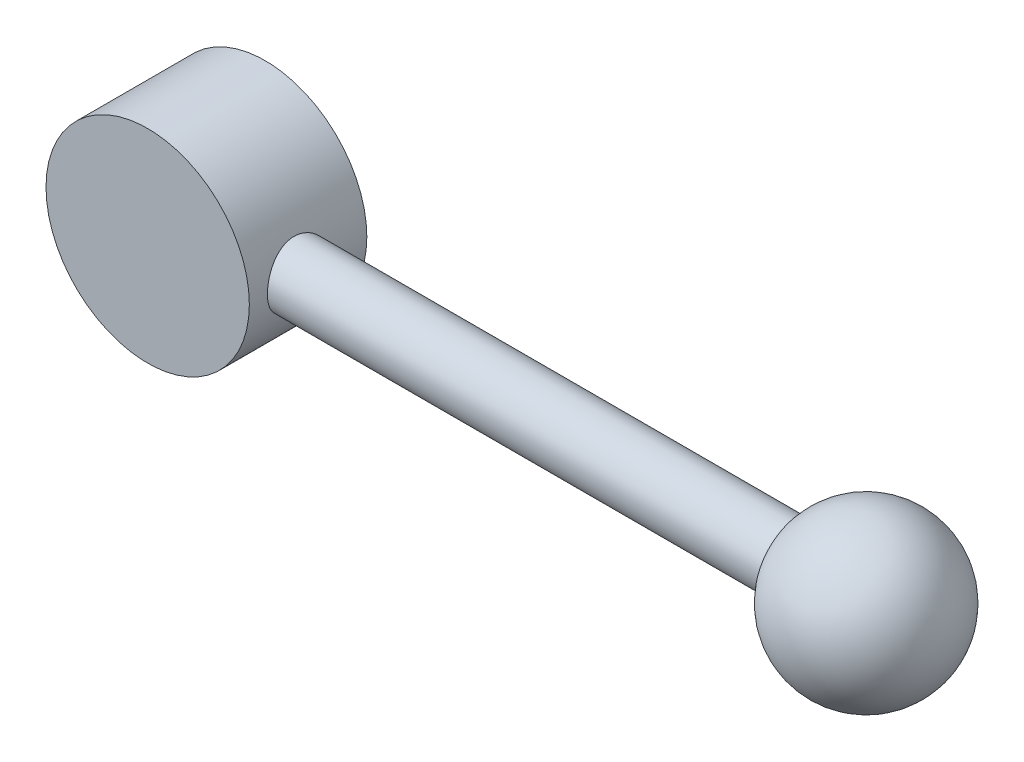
ISO-10303-21;
HEADER;
FILE_DESCRIPTION(('STEP AP214'),'2;1');
FILE_NAME('part.step','',(''),(''),'','','');
FILE_SCHEMA(('AUTOMOTIVE_DESIGN { 1 0 10303 214 1 1 1 1 }'));
ENDSEC;
DATA;
#1=APPLICATION_CONTEXT('core data for automotive mechanical design processes');
#2=APPLICATION_PROTOCOL_DEFINITION('international standard','automotive_design',2000,#1);
#3=PRODUCT_CONTEXT('',#1,'mechanical');
#4=PRODUCT('Part','Part','',(#3));
#5=PRODUCT_RELATED_PRODUCT_CATEGORY('part','',(#4));
#6=PRODUCT_DEFINITION_FORMATION('','',#4);
#7=PRODUCT_DEFINITION_CONTEXT('part definition',#1,'design');
#8=PRODUCT_DEFINITION('design','',#6,#7);
#9=PRODUCT_DEFINITION_SHAPE('','',#8);
#10=(LENGTH_UNIT() NAMED_UNIT(*) SI_UNIT(.MILLI.,.METRE.));
#11=(NAMED_UNIT(*) PLANE_ANGLE_UNIT() SI_UNIT($,.RADIAN.));
#12=(NAMED_UNIT(*) SI_UNIT($,.STERADIAN.) SOLID_ANGLE_UNIT());
#13=UNCERTAINTY_MEASURE_WITH_UNIT(LENGTH_MEASURE(1.E-05),#10,'distance_accuracy_value','');
#14=(GEOMETRIC_REPRESENTATION_CONTEXT(3) GLOBAL_UNCERTAINTY_ASSIGNED_CONTEXT((#13)) GLOBAL_UNIT_ASSIGNED_CONTEXT((#10,
#11,#12)) REPRESENTATION_CONTEXT('',''));
#15=CARTESIAN_POINT('',(0.,0.,0.));
#16=DIRECTION('',(0.,0.,1.));
#17=DIRECTION('',(1.,0.,0.));
#18=AXIS2_PLACEMENT_3D('',#15,#16,#17);
#19=CARTESIAN_POINT('',(0.,0.,0.));
#20=DIRECTION('',(0.,0.,1.));
#21=DIRECTION('',(1.,0.,0.));
#22=AXIS2_PLACEMENT_3D('',#19,#20,#21);
#23=PLANE('',#22);
#24=CARTESIAN_POINT('',(0.,0.,0.));
#25=DIRECTION('',(0.,0.,1.));
#26=DIRECTION('',(1.,0.,0.));
#27=AXIS2_PLACEMENT_3D('',#24,#25,#26);
#28=CIRCLE('',#27,11.5);
#29=CARTESIAN_POINT('',(11.5,0.,0.));
#30=VERTEX_POINT('',#29);
#31=EDGE_CURVE('E8',#30,#30,#28,.T.);
#32=ORIENTED_EDGE('',*,*,#31,.F.);
#33=EDGE_LOOP('',(#32));
#34=FACE_BOUND('',#33,.T.);
#35=CARTESIAN_POINT('',(0.,0.,0.));
#36=DIRECTION('',(0.,0.,-1.));
#37=DIRECTION('',(-1.,0.,0.));
#38=AXIS2_PLACEMENT_3D('',#35,#36,#37);
#39=CIRCLE('',#38,8.);
#40=CARTESIAN_POINT('',(-8.,0.,0.));
#41=VERTEX_POINT('',#40);
#42=EDGE_CURVE('E40',#41,#41,#39,.T.);
#43=ORIENTED_EDGE('',*,*,#42,.F.);
#44=EDGE_LOOP('',(#43));
#45=FACE_BOUND('',#44,.T.);
#46=ADVANCED_FACE('F12',(#34,#45),#23,.F.);
#47=CARTESIAN_POINT('',(0.,0.,40.));
#48=DIRECTION('',(0.,0.,1.));
#49=DIRECTION('',(1.,0.,0.));
#50=AXIS2_PLACEMENT_3D('',#47,#48,#49);
#51=CYLINDRICAL_SURFACE('',#50,11.5);
#52=CARTESIAN_POINT('',(0.,0.,2.));
#53=DIRECTION('',(0.,0.,1.));
#54=DIRECTION('',(1.,0.,0.));
#55=AXIS2_PLACEMENT_3D('',#52,#53,#54);
#56=CIRCLE('',#55,11.5);
#57=CARTESIAN_POINT('',(11.5,0.,2.));
#58=VERTEX_POINT('',#57);
#59=EDGE_CURVE('E34',#58,#58,#56,.T.);
#60=ORIENTED_EDGE('',*,*,#59,.F.);
#61=EDGE_LOOP('',(#60));
#62=FACE_BOUND('',#61,.T.);
#63=ORIENTED_EDGE('',*,*,#31,.T.);
#64=EDGE_LOOP('',(#63));
#65=FACE_BOUND('',#64,.T.);
#66=ADVANCED_FACE('F14',(#62,#65),#51,.T.);
#67=CARTESIAN_POINT('',(22.5,0.,28.));
#68=DIRECTION('',(0.,0.,-1.));
#69=DIRECTION('',(-1.,0.,0.));
#70=AXIS2_PLACEMENT_3D('',#67,#68,#69);
#71=PLANE('',#70);
#72=CARTESIAN_POINT('',(0.,0.,28.));
#73=DIRECTION('',(0.,0.,1.));
#74=DIRECTION('',(1.,0.,0.));
#75=AXIS2_PLACEMENT_3D('',#72,#73,#74);
#76=CIRCLE('',#75,22.5);
#77=CARTESIAN_POINT('',(22.5,0.,28.));
#78=VERTEX_POINT('',#77);
#79=EDGE_CURVE('E25',#78,#78,#76,.T.);
#80=ORIENTED_EDGE('',*,*,#79,.T.);
#81=EDGE_LOOP('',(#80));
#82=FACE_BOUND('',#81,.T.);
#83=ADVANCED_FACE('F70',(#82),#71,.F.);
#84=CARTESIAN_POINT('',(0.,0.,40.));
#85=DIRECTION('',(0.,0.,1.));
#86=DIRECTION('',(1.,0.,0.));
#87=AXIS2_PLACEMENT_3D('',#84,#85,#86);
#88=CYLINDRICAL_SURFACE('',#87,22.5);
#89=CARTESIAN_POINT('',(22.5,0.,10.));
#90=CARTESIAN_POINT('',(22.4999998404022,-0.191677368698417,10.0000002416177));
#91=CARTESIAN_POINT('',(22.4975448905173,-0.383358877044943,10.0078793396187));
#92=CARTESIAN_POINT('',(22.4877923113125,-0.765308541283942,10.0393229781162));
#93=CARTESIAN_POINT('',(22.4804945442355,-0.955576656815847,10.0628879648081));
#94=CARTESIAN_POINT('',(22.4612564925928,-1.33331254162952,10.1254869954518));
#95=CARTESIAN_POINT('',(22.4493161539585,-1.52078027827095,10.1645212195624));
#96=CARTESIAN_POINT('',(22.4211118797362,-1.89165112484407,10.2577281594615));
#97=CARTESIAN_POINT('',(22.4048463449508,-2.07505270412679,10.3119064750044));
#98=CARTESIAN_POINT('',(22.3684646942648,-2.43611329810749,10.4348153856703));
#99=CARTESIAN_POINT('',(22.3483561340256,-2.61378279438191,10.503517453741));
#100=CARTESIAN_POINT('',(22.3047888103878,-2.96265393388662,10.6550124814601));
#101=CARTESIAN_POINT('',(22.281328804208,-3.13385314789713,10.7378106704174));
#102=CARTESIAN_POINT('',(22.2316747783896,-3.46860942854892,10.9168465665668));
#103=CARTESIAN_POINT('',(22.2054814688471,-3.63216846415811,11.0130807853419));
#104=CARTESIAN_POINT('',(22.1510251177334,-3.95072830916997,11.2183306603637));
#105=CARTESIAN_POINT('',(22.1227612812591,-4.10572579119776,11.327351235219));
#106=CARTESIAN_POINT('',(22.0343532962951,-4.56462383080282,11.6788046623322));
#107=CARTESIAN_POINT('',(21.9719820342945,-4.85343322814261,11.9408249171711));
#108=CARTESIAN_POINT('',(21.8481078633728,-5.38374028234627,12.5092913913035));
#109=CARTESIAN_POINT('',(21.7866051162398,-5.62522922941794,12.8157457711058));
#110=CARTESIAN_POINT('',(21.6993823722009,-5.94977072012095,13.3067462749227));
#111=CARTESIAN_POINT('',(21.670827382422,-6.05269326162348,13.4779461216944));
#112=CARTESIAN_POINT('',(21.6165738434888,-6.24368405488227,13.8288405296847));
#113=CARTESIAN_POINT('',(21.5908741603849,-6.33175821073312,14.0085316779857));
#114=CARTESIAN_POINT('',(21.5431267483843,-6.49235835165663,14.3752387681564));
#115=CARTESIAN_POINT('',(21.5210797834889,-6.56488108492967,14.5622562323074));
#116=CARTESIAN_POINT('',(21.4813641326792,-6.69369414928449,14.9421700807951));
#117=CARTESIAN_POINT('',(21.4636935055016,-6.74999167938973,15.1350638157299));
#118=CARTESIAN_POINT('',(21.4337574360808,-6.84444485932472,15.5195916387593));
#119=CARTESIAN_POINT('',(21.4213480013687,-6.88308642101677,15.7110952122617));
#120=CARTESIAN_POINT('',(21.4016029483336,-6.94423696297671,16.0968445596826));
#121=CARTESIAN_POINT('',(21.3942652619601,-6.96675251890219,16.2910891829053));
#122=CARTESIAN_POINT('',(21.3848978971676,-6.99545358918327,16.6809027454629));
#123=CARTESIAN_POINT('',(21.382868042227,-7.00163964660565,16.8764716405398));
#124=CARTESIAN_POINT('',(21.3841835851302,-6.99762087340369,17.2674203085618));
#125=CARTESIAN_POINT('',(21.387528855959,-6.98741643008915,17.4628000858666));
#126=CARTESIAN_POINT('',(21.3992467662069,-6.95144410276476,17.8441910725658));
#127=CARTESIAN_POINT('',(21.4074162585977,-6.92630487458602,18.0302682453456));
#128=CARTESIAN_POINT('',(21.4283669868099,-6.86121389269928,18.3996136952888));
#129=CARTESIAN_POINT('',(21.4411497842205,-6.82125712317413,18.5828809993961));
#130=CARTESIAN_POINT('',(21.4709424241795,-6.7268919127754,18.9452428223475));
#131=CARTESIAN_POINT('',(21.4879510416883,-6.67248765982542,19.1243385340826));
#132=CARTESIAN_POINT('',(21.5257120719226,-6.54964475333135,19.4773149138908));
#133=CARTESIAN_POINT('',(21.5464659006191,-6.48120079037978,19.6511935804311));
#134=CARTESIAN_POINT('',(21.5914465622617,-6.32975192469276,19.9949996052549));
#135=CARTESIAN_POINT('',(21.6157183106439,-6.24655500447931,20.1648364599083));
#136=CARTESIAN_POINT('',(21.6668400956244,-6.06685791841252,20.4969847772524));
#137=CARTESIAN_POINT('',(21.6936910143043,-5.97035319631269,20.6592936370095));
#138=CARTESIAN_POINT('',(21.749239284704,-5.76471421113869,20.9753768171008));
#139=CARTESIAN_POINT('',(21.777936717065,-5.65557939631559,21.1291507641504));
#140=CARTESIAN_POINT('',(21.836423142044,-5.42537787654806,21.4272728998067));
#141=CARTESIAN_POINT('',(21.866212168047,-5.30431080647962,21.5716207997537));
#142=CARTESIAN_POINT('',(21.9274745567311,-5.0452320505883,21.8563713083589));
#143=CARTESIAN_POINT('',(21.958963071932,-4.90670110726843,21.9962986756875));
#144=CARTESIAN_POINT('',(22.0214157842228,-4.61833304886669,22.2639997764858));
#145=CARTESIAN_POINT('',(22.0523801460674,-4.46849957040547,22.3917773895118));
#146=CARTESIAN_POINT('',(22.1129608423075,-4.15835706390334,22.6344343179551));
#147=CARTESIAN_POINT('',(22.142576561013,-3.99804333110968,22.749307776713));
#148=CARTESIAN_POINT('',(22.1996210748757,-3.66808403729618,22.9652340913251));
#149=CARTESIAN_POINT('',(22.2270507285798,-3.4984421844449,23.0662923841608));
#150=CARTESIAN_POINT('',(22.2791891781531,-3.14946058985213,23.2546406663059));
#151=CARTESIAN_POINT('',(22.3038740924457,-2.97005333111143,23.341812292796));
#152=CARTESIAN_POINT('',(22.3495532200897,-2.60412187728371,23.5006396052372));
#153=CARTESIAN_POINT('',(22.3705488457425,-2.41760043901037,23.5723012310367));
#154=CARTESIAN_POINT('',(22.4082535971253,-2.03872672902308,23.6995165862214));
#155=CARTESIAN_POINT('',(22.4249629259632,-1.84637473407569,23.7550710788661));
#156=CARTESIAN_POINT('',(22.4536048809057,-1.45728257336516,23.8495549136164));
#157=CARTESIAN_POINT('',(22.4655376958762,-1.26054258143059,23.8884849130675));
#158=CARTESIAN_POINT('',(22.4839130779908,-0.871811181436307,23.948173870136));
#159=CARTESIAN_POINT('',(22.4905485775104,-0.679926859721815,23.9695722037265));
#160=CARTESIAN_POINT('',(22.4988905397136,-0.294941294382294,23.9964448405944));
#161=CARTESIAN_POINT('',(22.5005971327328,-0.101840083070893,24.001919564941));
#162=CARTESIAN_POINT('',(22.4990337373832,0.284107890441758,23.9968939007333));
#163=CARTESIAN_POINT('',(22.4957643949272,0.476954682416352,23.9863955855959));
#164=CARTESIAN_POINT('',(22.4843416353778,0.860977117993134,23.9495270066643));
#165=CARTESIAN_POINT('',(22.4761882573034,1.0521527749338,23.9231568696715));
#166=CARTESIAN_POINT('',(22.4554847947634,1.42671362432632,23.8556400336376));
#167=CARTESIAN_POINT('',(22.4430488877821,1.61017439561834,23.8148764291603));
#168=CARTESIAN_POINT('',(22.4140684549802,1.97298394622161,23.7188213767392));
#169=CARTESIAN_POINT('',(22.3975225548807,2.15233132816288,23.6635250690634));
#170=CARTESIAN_POINT('',(22.3607552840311,2.50562583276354,23.5388775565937));
#171=CARTESIAN_POINT('',(22.3405349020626,2.67957439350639,23.4695301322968));
#172=CARTESIAN_POINT('',(22.2969201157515,3.02109307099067,23.3172751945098));
#173=CARTESIAN_POINT('',(22.2735245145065,3.18866075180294,23.2343625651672));
#174=CARTESIAN_POINT('',(22.2235592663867,3.5202550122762,23.0534553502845));
#175=CARTESIAN_POINT('',(22.196927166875,3.68410148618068,22.9551479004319));
#176=CARTESIAN_POINT('',(22.1416334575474,4.00303333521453,22.7456195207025));
#177=CARTESIAN_POINT('',(22.1129711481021,4.15811565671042,22.6343941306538));
#178=CARTESIAN_POINT('',(22.0543595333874,4.45854845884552,22.3997845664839));
#179=CARTESIAN_POINT('',(22.0244101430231,4.60389829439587,22.2763995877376));
#180=CARTESIAN_POINT('',(21.9639950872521,4.88399953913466,22.0182492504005));
#181=CARTESIAN_POINT('',(21.9335294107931,5.01875072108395,21.8834836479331));
#182=CARTESIAN_POINT('',(21.8716714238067,5.28194864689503,21.5978479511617));
#183=CARTESIAN_POINT('',(21.8402900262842,5.40993633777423,21.446552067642));
#184=CARTESIAN_POINT('',(21.778722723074,5.65269114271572,21.133557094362));
#185=CARTESIAN_POINT('',(21.7485364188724,5.7674626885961,20.9718615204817));
#186=CARTESIAN_POINT('',(21.6902133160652,5.98307012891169,20.6389845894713));
#187=CARTESIAN_POINT('',(21.6620773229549,6.08390056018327,20.4677995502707));
#188=CARTESIAN_POINT('',(21.6087222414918,6.27077082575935,20.1171905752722));
#189=CARTESIAN_POINT('',(21.5835019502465,6.35681676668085,19.9377700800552));
#190=CARTESIAN_POINT('',(21.5368298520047,6.51318654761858,19.5724944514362));
#191=CARTESIAN_POINT('',(21.5153649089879,6.58356543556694,19.3866645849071));
#192=CARTESIAN_POINT('',(21.4767854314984,6.70834974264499,19.0093553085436));
#193=CARTESIAN_POINT('',(21.4596691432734,6.76276160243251,18.8178782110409));
#194=CARTESIAN_POINT('',(21.4303403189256,6.85513428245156,18.4306463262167));
#195=CARTESIAN_POINT('',(21.4181272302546,6.89309695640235,18.2348920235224));
#196=CARTESIAN_POINT('',(21.3990152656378,6.95220219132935,17.8406058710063));
#197=CARTESIAN_POINT('',(21.3921161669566,6.97334545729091,17.6420741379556));
#198=CARTESIAN_POINT('',(21.3840536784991,6.99802863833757,17.2527924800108));
#199=CARTESIAN_POINT('',(21.3826459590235,7.00231848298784,17.0620947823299));
#200=CARTESIAN_POINT('',(21.3849355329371,6.99532322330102,16.6809486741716));
#201=CARTESIAN_POINT('',(21.3886345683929,6.98403280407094,16.4905003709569));
#202=CARTESIAN_POINT('',(21.4010215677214,6.94598254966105,16.1114036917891));
#203=CARTESIAN_POINT('',(21.4097074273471,6.91922923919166,15.9227545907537));
#204=CARTESIAN_POINT('',(21.4317998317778,6.8504931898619,15.5484622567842));
#205=CARTESIAN_POINT('',(21.445208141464,6.80850475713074,15.3628201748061));
#206=CARTESIAN_POINT('',(21.4761044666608,6.7104051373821,14.9986247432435));
#207=CARTESIAN_POINT('',(21.4935291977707,6.65451205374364,14.8200071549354));
#208=CARTESIAN_POINT('',(21.532065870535,6.52874130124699,14.4681109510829));
#209=CARTESIAN_POINT('',(21.553179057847,6.45885890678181,14.294834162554));
#210=CARTESIAN_POINT('',(21.598497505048,6.30565478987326,13.9547580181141));
#211=CARTESIAN_POINT('',(21.622702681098,6.22233343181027,13.7879584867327));
#212=CARTESIAN_POINT('',(21.6735512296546,6.04283665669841,13.4618116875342));
#213=CARTESIAN_POINT('',(21.7001947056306,5.94666069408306,13.3024647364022));
#214=CARTESIAN_POINT('',(21.7562945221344,5.73809693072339,12.9860832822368));
#215=CARTESIAN_POINT('',(21.7858200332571,5.62522322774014,12.8293812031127));
#216=CARTESIAN_POINT('',(21.8459271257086,5.38707171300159,12.5260042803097));
#217=CARTESIAN_POINT('',(21.876508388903,5.26179761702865,12.3793264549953));
#218=CARTESIAN_POINT('',(21.9379319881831,4.9995285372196,12.0967465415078));
#219=CARTESIAN_POINT('',(21.9687744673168,4.86252669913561,11.9608508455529));
#220=CARTESIAN_POINT('',(22.0298741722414,4.57775496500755,11.7008184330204));
#221=CARTESIAN_POINT('',(22.0601315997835,4.42998886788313,11.5766776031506));
#222=CARTESIAN_POINT('',(22.1202447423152,4.11953578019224,11.3370395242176));
#223=CARTESIAN_POINT('',(22.1500549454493,3.95651883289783,11.2219578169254));
#224=CARTESIAN_POINT('',(22.207366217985,3.62102613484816,11.0060070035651));
#225=CARTESIAN_POINT('',(22.2348681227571,3.44855384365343,10.9051327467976));
#226=CARTESIAN_POINT('',(22.286793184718,3.09527336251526,10.7183440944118));
#227=CARTESIAN_POINT('',(22.3112167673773,2.91446632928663,10.6324276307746));
#228=CARTESIAN_POINT('',(22.3562872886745,2.54576090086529,10.4762606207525));
#229=CARTESIAN_POINT('',(22.3769345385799,2.35786309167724,10.4060087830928));
#230=CARTESIAN_POINT('',(22.4122437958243,1.99297373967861,10.2872063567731));
#231=CARTESIAN_POINT('',(22.4272705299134,1.81645819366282,10.2372983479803));
#232=CARTESIAN_POINT('',(22.4533075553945,1.45977603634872,10.1514456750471));
#233=CARTESIAN_POINT('',(22.4643180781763,1.27960963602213,10.1155002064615));
#234=CARTESIAN_POINT('',(22.4820479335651,0.916792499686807,10.0578654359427));
#235=CARTESIAN_POINT('',(22.4887670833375,0.734141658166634,10.0361767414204));
#236=CARTESIAN_POINT('',(22.4977423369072,0.36766149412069,10.007246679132));
#237=CARTESIAN_POINT('',(22.500000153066,0.183832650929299,9.99999976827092));
#238=CARTESIAN_POINT('',(22.5,0.,10.));
#239=B_SPLINE_CURVE_WITH_KNOTS('',3,(#89,#90,#91,#92,#93,#94,#95,#96,#97,#98,#99,#100,#101,#102,
#103,#104,#105,#106,#107,#108,#109,#110,#111,#112,#113,#114,#115,#116,#117,#118,#119,#120,#121,
#122,#123,#124,#125,#126,#127,#128,#129,#130,#131,#132,#133,#134,#135,#136,#137,#138,#139,#140,
#141,#142,#143,#144,#145,#146,#147,#148,#149,#150,#151,#152,#153,#154,#155,#156,#157,#158,#159,
#160,#161,#162,#163,#164,#165,#166,#167,#168,#169,#170,#171,#172,#173,#174,#175,#176,#177,#178,
#179,#180,#181,#182,#183,#184,#185,#186,#187,#188,#189,#190,#191,#192,#193,#194,#195,#196,#197,
#198,#199,#200,#201,#202,#203,#204,#205,#206,#207,#208,#209,#210,#211,#212,#213,#214,#215,#216,
#217,#218,#219,#220,#221,#222,#223,#224,#225,#226,#227,#228,#229,#230,#231,#232,#233,#234,#235,
#236,#237,#238),.UNSPECIFIED.,.T.,.F.,(4,2,2,2,2,2,2,2,2,2,2,2,2,2,2,2,2,2,2,2,2,2,2,2,2,2,2,2,
2,2,2,2,2,2,2,2,2,2,2,2,2,2,2,2,2,2,2,2,2,2,2,2,2,2,2,2,2,2,2,2,2,2,2,2,2,2,2,2,2,2,2,2,2,2,4),
(0.,0.574862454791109,1.14974126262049,1.72462676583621,2.29972512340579,2.87370421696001,
3.44789670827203,4.02194039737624,4.59620563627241,5.77524816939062,6.95450751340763,
7.55923977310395,8.16373100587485,8.76834851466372,9.37269734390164,9.95922932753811,
10.5455220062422,11.1317951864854,11.7180545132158,12.2812290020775,12.8445943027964,
13.4077964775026,13.9712120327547,14.5425858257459,15.1141557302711,15.6857506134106,
16.2573629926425,16.85487964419,17.4522048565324,18.0498000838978,18.6471594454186,
19.2493655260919,19.8513405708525,20.4532870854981,21.0552097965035,21.6340578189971,
22.2128905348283,22.7916481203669,23.3704010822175,23.9347859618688,24.499359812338,
25.0637819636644,25.6284174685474,26.2065358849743,26.7848545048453,27.3632114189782,
27.9415807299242,28.5427881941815,29.1437934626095,29.74503358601,30.3460247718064,
30.9448697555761,31.5434728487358,32.1420084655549,32.7405189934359,33.3120739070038,
33.8838238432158,34.4553327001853,35.0270553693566,35.5903206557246,36.1537765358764,
36.7172171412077,37.2806816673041,37.8661164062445,38.4513762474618,39.0369805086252,
39.6223790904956,40.2269255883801,40.8312523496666,41.4354954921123,42.0396888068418,
42.5912440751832,43.1427675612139,43.6943145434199,44.2456497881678),.UNSPECIFIED.);
#240=CARTESIAN_POINT('',(22.5,0.,10.));
#241=VERTEX_POINT('',#240);
#242=EDGE_CURVE('E16',#241,#241,#239,.T.);
#243=ORIENTED_EDGE('',*,*,#242,.T.);
#244=EDGE_LOOP('',(#243));
#245=FACE_BOUND('',#244,.T.);
#246=ORIENTED_EDGE('',*,*,#79,.F.);
#247=EDGE_LOOP('',(#246));
#248=FACE_BOUND('',#247,.T.);
#249=CARTESIAN_POINT('',(0.,0.,2.));
#250=DIRECTION('',(0.,0.,1.));
#251=DIRECTION('',(1.,0.,0.));
#252=AXIS2_PLACEMENT_3D('',#249,#250,#251);
#253=CIRCLE('',#252,22.5);
#254=CARTESIAN_POINT('',(22.5,0.,2.));
#255=VERTEX_POINT('',#254);
#256=EDGE_CURVE('E29',#255,#255,#253,.T.);
#257=ORIENTED_EDGE('',*,*,#256,.T.);
#258=EDGE_LOOP('',(#257));
#259=FACE_BOUND('',#258,.T.);
#260=ADVANCED_FACE('F75',(#245,#248,#259),#88,.T.);
#261=CARTESIAN_POINT('',(11.5,0.,2.));
#262=DIRECTION('',(0.,0.,1.));
#263=DIRECTION('',(1.,0.,0.));
#264=AXIS2_PLACEMENT_3D('',#261,#262,#263);
#265=PLANE('',#264);
#266=ORIENTED_EDGE('',*,*,#256,.F.);
#267=EDGE_LOOP('',(#266));
#268=FACE_BOUND('',#267,.T.);
#269=ORIENTED_EDGE('',*,*,#59,.T.);
#270=EDGE_LOOP('',(#269));
#271=FACE_BOUND('',#270,.T.);
#272=ADVANCED_FACE('F80',(#268,#271),#265,.F.);
#273=CARTESIAN_POINT('',(-30.,0.,17.));
#274=DIRECTION('',(-1.,0.,0.));
#275=DIRECTION('',(0.,0.,1.));
#276=AXIS2_PLACEMENT_3D('',#273,#274,#275);
#277=CYLINDRICAL_SURFACE('',#276,7.);
#278=CARTESIAN_POINT('',(131.960985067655,0.,17.));
#279=DIRECTION('',(-1.,0.,0.));
#280=DIRECTION('',(0.,0.,1.));
#281=AXIS2_PLACEMENT_3D('',#278,#279,#280);
#282=CIRCLE('',#281,7.);
#283=CARTESIAN_POINT('',(131.960985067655,0.,24.));
#284=VERTEX_POINT('',#283);
#285=EDGE_CURVE('E37',#284,#284,#282,.T.);
#286=ORIENTED_EDGE('',*,*,#285,.T.);
#287=EDGE_LOOP('',(#286));
#288=FACE_BOUND('',#287,.T.);
#289=ORIENTED_EDGE('',*,*,#242,.F.);
#290=EDGE_LOOP('',(#289));
#291=FACE_BOUND('',#290,.T.);
#292=ADVANCED_FACE('F61',(#288,#291),#277,.T.);
#293=CARTESIAN_POINT('',(148.,0.,17.));
#294=DIRECTION('',(0.,0.,1.));
#295=DIRECTION('',(1.,0.,0.));
#296=AXIS2_PLACEMENT_3D('',#293,#294,#295);
#297=SPHERICAL_SURFACE('',#296,17.5);
#298=CARTESIAN_POINT('',(148.,0.,17.));
#299=DIRECTION('',(-1.,0.,0.));
#300=DIRECTION('',(0.,0.,1.));
#301=AXIS2_PLACEMENT_3D('',#298,#299,#300);
#302=SPHERICAL_SURFACE('',#301,17.5);
#303=ORIENTED_EDGE('',*,*,#285,.F.);
#304=EDGE_LOOP('',(#303));
#305=FACE_BOUND('',#304,.T.);
#306=ADVANCED_FACE('F51',(#305),#302,.T.);
#307=CARTESIAN_POINT('',(0.,0.,0.));
#308=DIRECTION('',(0.,0.,-1.));
#309=DIRECTION('',(-1.,0.,0.));
#310=AXIS2_PLACEMENT_3D('',#307,#308,#309);
#311=CYLINDRICAL_SURFACE('',#310,8.);
#312=ORIENTED_EDGE('',*,*,#42,.T.);
#313=EDGE_LOOP('',(#312));
#314=FACE_BOUND('',#313,.T.);
#315=CARTESIAN_POINT('',(0.,0.,27.));
#316=DIRECTION('',(0.,0.,-1.));
#317=DIRECTION('',(-1.,0.,0.));
#318=AXIS2_PLACEMENT_3D('',#315,#316,#317);
#319=CIRCLE('',#318,8.);
#320=CARTESIAN_POINT('',(-8.,0.,27.));
#321=VERTEX_POINT('',#320);
#322=EDGE_CURVE('E43',#321,#321,#319,.T.);
#323=ORIENTED_EDGE('',*,*,#322,.F.);
#324=EDGE_LOOP('',(#323));
#325=FACE_BOUND('',#324,.T.);
#326=ADVANCED_FACE('F49',(#314,#325),#311,.F.);
#327=CARTESIAN_POINT('',(0.,0.,27.));
#328=DIRECTION('',(0.,0.,-1.));
#329=DIRECTION('',(-1.,0.,0.));
#330=AXIS2_PLACEMENT_3D('',#327,#328,#329);
#331=PLANE('',#330);
#332=ORIENTED_EDGE('',*,*,#322,.T.);
#333=EDGE_LOOP('',(#332));
#334=FACE_BOUND('',#333,.T.);
#335=ADVANCED_FACE('F47',(#334),#331,.T.);
#336=CLOSED_SHELL('',(#46,#66,#83,#260,#272,#292,#306,#326,#335));
#337=MANIFOLD_SOLID_BREP('B1',#336);
#338=ADVANCED_BREP_SHAPE_REPRESENTATION('',(#18,#337),#14);
#339=SHAPE_DEFINITION_REPRESENTATION(#9,#338);
ENDSEC;
END-ISO-10303-21;
